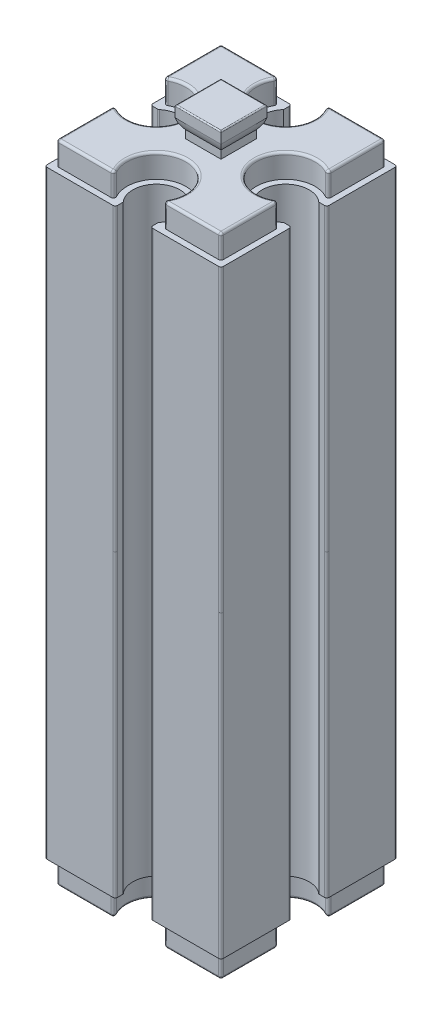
from build123d import *

# Parameters (mm, degrees)
EXTRUDE_1_DEPTH        = 25.5
EXTRUDE_2_DEPTH        = 2
EXTRUDE_3_DEPTH        = 2
FILLET_3_R             = 0.2
CUT_EXTRUDE_1_DEPTH    = 3
FILLET_4_R             = 0.2
FILLET_5_R             = 0.1
FILLET_3_OF_MIRROR_1_R = 0.2
FILLET_4_OF_MIRROR_1_R = 0.2
FILLET_5_OF_MIRROR_1_R = 0.1


with BuildPart() as part:
    # Sketch 1 → Extrude 1 (new body)
    with BuildSketch(Plane(origin=(0, 0, 0), x_dir=(1, 0, 0), z_dir=(0, 1, 0))):
        with BuildLine():
            Line((-7.5, 7.5), (-1.5, 7.5))
            Line((-1.5, 7.5), (-1.5, 6.822875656))
            ThreePointArc((-1.5, 6.822875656), (0, 3.5), (1.5, 6.822875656))
            Line((1.5, 6.822875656), (1.5, 7.5))
            Line((1.5, 7.5), (7.5, 7.5))
            Line((7.5, 7.5), (7.5, 1.5))
            Line((7.5, 1.5), (6.822875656, 1.5))
            ThreePointArc((6.822875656, 1.5), (3.5, 0), (6.822875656, -1.5))
            Line((6.822875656, -1.5), (7.5, -1.5))
            Line((7.5, -1.5), (7.5, -7.5))
            Line((7.5, -7.5), (1.5, -7.5))
            Line((1.5, -7.5), (1.5, -6.822875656))
            ThreePointArc((1.5, -6.822875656), (0, -3.5), (-1.5, -6.822875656))
            Line((-1.5, -6.822875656), (-1.5, -7.5))
            Line((-1.5, -7.5), (-7.5, -7.5))
            Line((-7.5, -7.5), (-7.5, -1.5))
            Line((-7.5, -1.5), (-6.822875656, -1.5))
            ThreePointArc((-6.822875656, -1.5), (-3.5, 0), (-6.822875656, 1.5))
            Line((-6.822875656, 1.5), (-7.5, 1.5))
            Line((-7.5, 1.5), (-7.5, 7.5))
        make_face()
    extrude_1 = extrude(amount=EXTRUDE_1_DEPTH)

    # Sketch 2 → Extrude 2 (add)
    with BuildSketch(Plane(origin=(0, 25.5, 0), x_dir=(1, 0, 0), z_dir=(0, 1, 0))):
        with BuildLine():
            Line((-7, 7), (-7, 2))
            ThreePointArc((-7, 2), (-3, 0), (-7, -2))
            Line((-7, -2), (-7, -7))
            Line((-7, -7), (-2, -7))
            ThreePointArc((-2, -7), (0, -3), (2, -7))
            Line((2, -7), (7, -7))
            Line((7, -7), (7, -2))
            ThreePointArc((7, -2), (3, 0), (7, 2))
            Line((7, 2), (7, 7))
            Line((7, 7), (2, 7))
            ThreePointArc((2, 7), (0, 3), (-2, 7))
            Line((-2, 7), (-7, 7))
        make_face()
    extrude_2 = extrude(amount=EXTRUDE_2_DEPTH)

    # Sketch 3 → Extrude 3 (add, symmetric)
    with BuildSketch(Plane(origin=(0, 0, 0), x_dir=(0, 0, -1), z_dir=(1, 0, 0))):
        with BuildLine():
            Line((-1.5, 27.5), (1.5, 27.5))
            Line((1.5, 27.5), (1.5, 28.177124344))
            ThreePointArc((1.5, 28.177124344), (1.780042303, 28.588161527), (1.95, 29.055590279))
            Line((1.95, 29.055590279), (1.95, 30))
            Line((1.95, 30), (-1.95, 30))
            Line((-1.95, 30), (-1.95, 29.055590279))
            ThreePointArc((-1.95, 29.055590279), (-1.780042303, 28.588161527), (-1.5, 28.177124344))
            Line((-1.5, 28.177124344), (-1.5, 27.5))
        make_face()
    extrude_3 = extrude(amount=EXTRUDE_3_DEPTH, both=True)

    # Fillet 3
    fillet_3_edges = [part.edges().sort_by_distance(p)[0] for p in [
        (-7.5, 12.75, -7.5),
        (-1.5, 12.75, -7.5),
        (1.5, 12.75, -7.5),
        (7.5, 12.75, -7.5),
        (7.5, 12.75, -1.5),
        (7.5, 12.75, 1.5),
        (7.5, 12.75, 7.5),
        (1.5, 12.75, 7.5),
        (-1.5, 12.75, 7.5),
        (-7.5, 12.75, 7.5),
        (-7.5, 12.75, 1.5),
        (-6.822875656, 12.75, -1.5),
        (-7.5, 12.75, -1.5),
    ]]
    fillet(fillet_3_edges, radius=FILLET_3_R)

    # Sketch 4 → Cut-Extrude 1 (cut, symmetric)
    with BuildSketch(Plane.XY):
        with BuildLine():
            Line((1.95, 30), (2, 30))
            Line((2, 30), (2, 27.5))
            Line((2, 27.5), (1.5, 27.5))
            Line((1.5, 27.5), (1.5, 28.177124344))
            ThreePointArc((1.5, 28.177124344), (1.780042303, 28.588161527), (1.95, 29.055590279))
            Line((1.95, 29.055590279), (1.95, 30))
        make_face()
        with BuildLine():
            Line((-1.95, 30), (-1.95, 29.055590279))
            ThreePointArc((-1.95, 29.055590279), (-1.780042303, 28.588161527), (-1.5, 28.177124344))
            Line((-1.5, 28.177124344), (-1.5, 27.5))
            Line((-1.5, 27.5), (-2, 27.5))
            Line((-2, 27.5), (-2, 30))
            Line((-2, 30), (-1.95, 30))
        make_face()
    cut_extrude_1 = extrude(amount=CUT_EXTRUDE_1_DEPTH, both=True, mode=Mode.SUBTRACT)

    # Fillet 4
    fillet_4_edges = [part.edges().sort_by_distance(p)[0] for p in [
        (-2, 26.5, -7),
        (-7, 26.5, -7),
        (-7, 26.5, -2),
        (-7, 26.5, 2),
        (-7, 26.5, 7),
        (-2, 26.5, 7),
        (2, 26.5, 7),
        (7, 26.5, 7),
        (7, 26.5, 2),
        (7, 26.5, -2),
        (7, 26.5, -7),
        (2, 26.5, -7),
        (-4.5, 27.5, -7),
        (-7, 27.5, -4.5),
        (-3, 27.5, 0),
        (-7, 27.5, 4.5),
        (-4.5, 27.5, 7),
        (0, 27.5, 3),
        (4.5, 27.5, 7),
        (7, 27.5, 4.5),
        (3, 27.5, 0),
        (7, 27.5, -4.5),
        (4.5, 27.5, -7),
        (0, 27.5, -3),
    ]]
    fillet(fillet_4_edges, radius=FILLET_4_R)

    # Fillet 5
    fillet_5_edges = [part.edges().sort_by_distance(p)[0] for p in [
        (1.95, 30, 0),
        (0, 30, -1.95),
        (0, 30, 1.95),
        (-1.95, 30, 0),
    ]]
    fillet(fillet_5_edges, radius=FILLET_5_R)


with BuildPart() as mirror_1_1:
    # Mirror 1: Extrude 1, Extrude 2, Extrude 3 across Top Plane
    add(extrude_1.mirror(Plane(origin=(0, 0, 0), x_dir=(1, 0, 0), z_dir=(0, 1, 0))))
    add(extrude_2.mirror(Plane(origin=(0, 0, 0), x_dir=(1, 0, 0), z_dir=(0, 1, 0))))
    add(extrude_3.mirror(Plane(origin=(0, 0, 0), x_dir=(1, 0, 0), z_dir=(0, 1, 0))))

    # Mirror 1 2: Cut-Extrude 1 across Top Plane
    add(cut_extrude_1.mirror(Plane(origin=(0, 0, 0), x_dir=(1, 0, 0), z_dir=(0, 1, 0))), mode=Mode.SUBTRACT)

    # Fillet 3 of Mirror 1
    fillet_3_of_mirror_1_edges = [mirror_1_1.edges().sort_by_distance(p)[0] for p in [
        (-7.5, -12.75, -7.5),
        (-1.5, -12.75, -7.5),
        (1.5, -12.75, -7.5),
        (7.5, -12.75, -7.5),
        (7.5, -12.75, -1.5),
        (7.5, -12.75, 1.5),
        (7.5, -12.75, 7.5),
        (1.5, -12.75, 7.5),
        (-1.5, -12.75, 7.5),
        (-7.5, -12.75, 7.5),
        (-7.5, -12.75, 1.5),
        (-6.822875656, -12.75, -1.5),
        (-7.5, -12.75, -1.5),
    ]]
    fillet(fillet_3_of_mirror_1_edges, radius=FILLET_3_OF_MIRROR_1_R)

    # Fillet 4 of Mirror 1
    fillet_4_of_mirror_1_edges = [mirror_1_1.edges().sort_by_distance(p)[0] for p in [
        (-2, -26.5, -7),
        (-7, -26.5, -7),
        (-7, -26.5, -2),
        (-7, -26.5, 2),
        (-7, -26.5, 7),
        (-2, -26.5, 7),
        (2, -26.5, 7),
        (7, -26.5, 7),
        (7, -26.5, 2),
        (7, -26.5, -2),
        (7, -26.5, -7),
        (2, -26.5, -7),
        (-4.5, -27.5, -7),
        (-7, -27.5, -4.5),
        (-3, -27.5, 0),
        (-7, -27.5, 4.5),
        (-4.5, -27.5, 7),
        (0, -27.5, 3),
        (4.5, -27.5, 7),
        (7, -27.5, 4.5),
        (3, -27.5, 0),
        (7, -27.5, -4.5),
        (4.5, -27.5, -7),
        (0, -27.5, -3),
    ]]
    fillet(fillet_4_of_mirror_1_edges, radius=FILLET_4_OF_MIRROR_1_R)

    # Fillet 5 of Mirror 1
    fillet_5_of_mirror_1_edges = [mirror_1_1.edges().sort_by_distance(p)[0] for p in [
        (1.95, -30, 0),
        (0, -30, -1.95),
        (0, -30, 1.95),
        (-1.95, -30, 0),
    ]]
    fillet(fillet_5_of_mirror_1_edges, radius=FILLET_5_OF_MIRROR_1_R)


with BuildPart() as part_1:
    add(part.part)

    # Mirror 1 united with what the copies tou: union Mirror 1_1
    add(mirror_1_1.part)


solid = part_1.part
